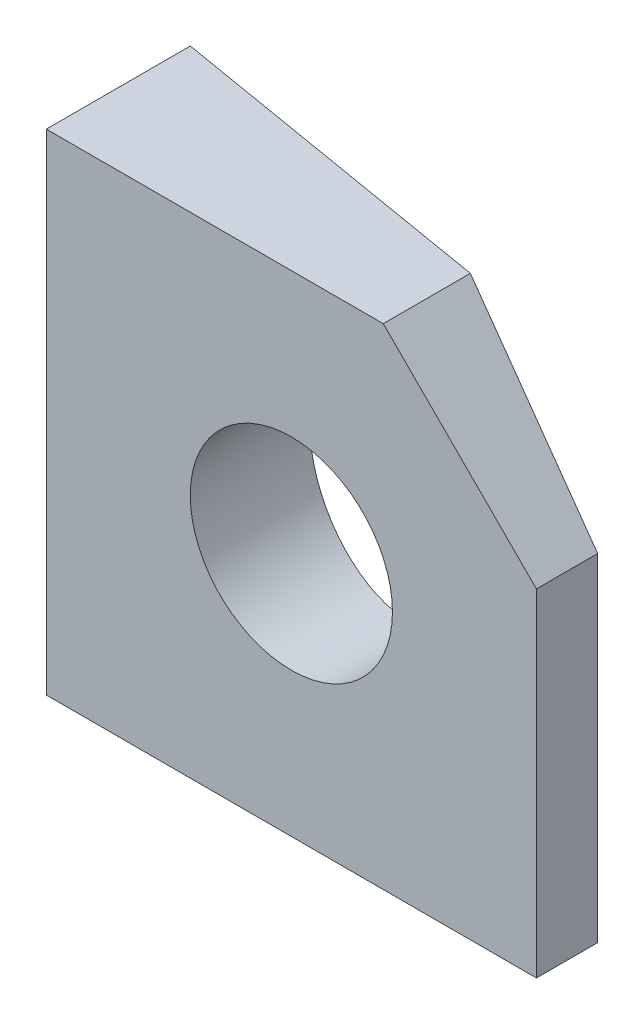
from build123d import *

# Parameters (mm, degrees)
SKETCH1_W          = 16
SKETCH1_H          = 16
SKETCH1_R          = 3.3
BASE_EXTRUDE_DEPTH = 4.7
CUT_EXTRUDE1_DEPTH = 19.322685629
CHAMFER1_SIZE      = 5


with BuildPart() as part:
    # Sketch1 → Base-Extrude (new body)
    with BuildSketch(Plane.XY):
        Rectangle(SKETCH1_W, SKETCH1_H)
        Circle(SKETCH1_R, mode=Mode.SUBTRACT)
    extrude(amount=-BASE_EXTRUDE_DEPTH)

    # Sketch2 → Cut-Extrude1 (cut, through all)
    with BuildSketch(Plane(origin=(-0.214746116, 8, -3.498393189), x_dir=(-1, 0, 0), z_dir=(0, 1, 0))):
        Polygon((-8.214746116, -1.201606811), (7.785253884, -1.201606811), (-8.214746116, 1.498393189), align=None)
    extrude(amount=-CUT_EXTRUDE1_DEPTH, mode=Mode.SUBTRACT)

    # Chamfer1
    chamfer1_edges = [part.edges().sort_by_distance(p)[0] for p in [
        (8, 8, -1),
    ]]
    chamfer(chamfer1_edges, length=CHAMFER1_SIZE)


solid = part.part
